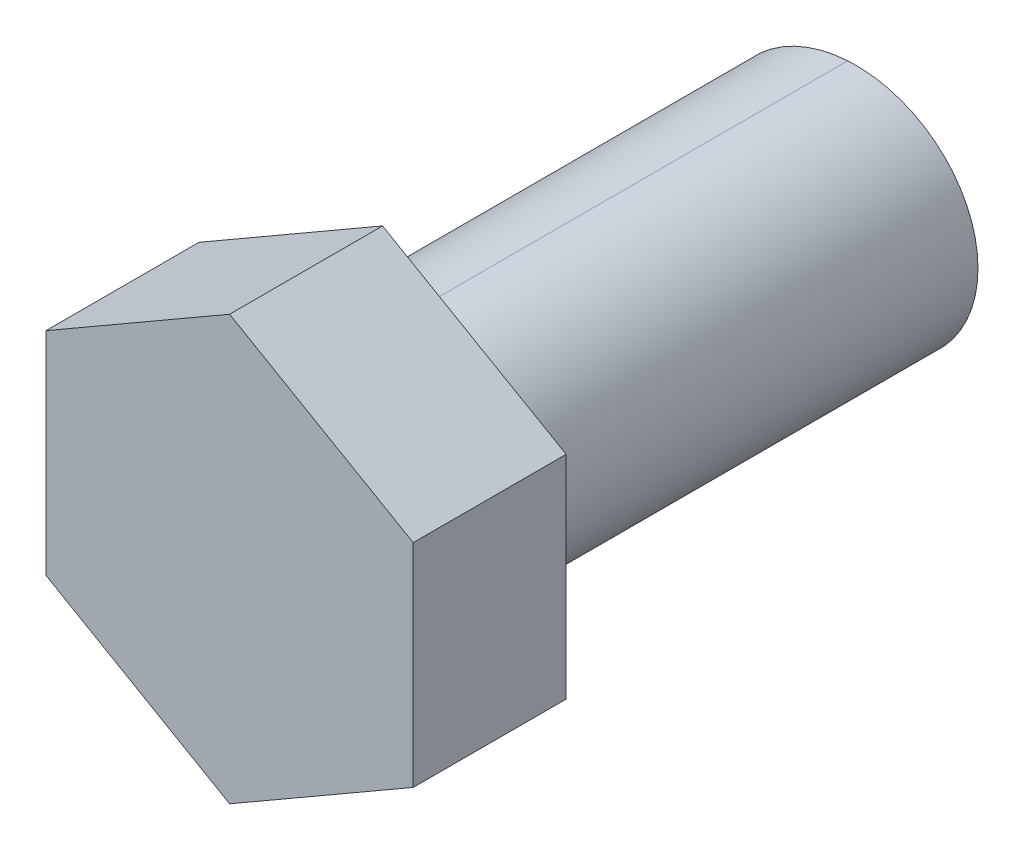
ISO-10303-21;
HEADER;
FILE_DESCRIPTION(('STEP AP214'),'2;1');
FILE_NAME('part.step','',(''),(''),'','','');
FILE_SCHEMA(('AUTOMOTIVE_DESIGN { 1 0 10303 214 1 1 1 1 }'));
ENDSEC;
DATA;
#1=APPLICATION_CONTEXT('core data for automotive mechanical design processes');
#2=APPLICATION_PROTOCOL_DEFINITION('international standard','automotive_design',2000,#1);
#3=PRODUCT_CONTEXT('',#1,'mechanical');
#4=PRODUCT('Part','Part','',(#3));
#5=PRODUCT_RELATED_PRODUCT_CATEGORY('part','',(#4));
#6=PRODUCT_DEFINITION_FORMATION('','',#4);
#7=PRODUCT_DEFINITION_CONTEXT('part definition',#1,'design');
#8=PRODUCT_DEFINITION('design','',#6,#7);
#9=PRODUCT_DEFINITION_SHAPE('','',#8);
#10=(LENGTH_UNIT() NAMED_UNIT(*) SI_UNIT(.MILLI.,.METRE.));
#11=(NAMED_UNIT(*) PLANE_ANGLE_UNIT() SI_UNIT($,.RADIAN.));
#12=(NAMED_UNIT(*) SI_UNIT($,.STERADIAN.) SOLID_ANGLE_UNIT());
#13=UNCERTAINTY_MEASURE_WITH_UNIT(LENGTH_MEASURE(1.E-05),#10,'distance_accuracy_value','');
#14=(GEOMETRIC_REPRESENTATION_CONTEXT(3) GLOBAL_UNCERTAINTY_ASSIGNED_CONTEXT((#13)) GLOBAL_UNIT_ASSIGNED_CONTEXT((#10,
#11,#12)) REPRESENTATION_CONTEXT('',''));
#15=CARTESIAN_POINT('',(0.,0.,0.));
#16=DIRECTION('',(0.,0.,1.));
#17=DIRECTION('',(1.,0.,0.));
#18=AXIS2_PLACEMENT_3D('',#15,#16,#17);
#19=CARTESIAN_POINT('',(9.525,5.49926131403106,16.2385888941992));
#20=DIRECTION('',(0.,0.,-1.));
#21=DIRECTION('',(-1.,0.,0.));
#22=AXIS2_PLACEMENT_3D('',#19,#20,#21);
#23=PLANE('',#22);
#24=DIRECTION('',(-0.866025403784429,0.500000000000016,0.));
#25=VECTOR('',#24,1.);
#26=CARTESIAN_POINT('',(0.,10.9985226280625,16.2385888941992));
#27=LINE('',#26,#25);
#28=CARTESIAN_POINT('',(0.,10.9985226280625,16.2385888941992));
#29=VERTEX_POINT('',#28);
#30=CARTESIAN_POINT('',(9.525,5.49926131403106,16.2385888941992));
#31=VERTEX_POINT('',#30);
#32=EDGE_CURVE('E116',#29,#31,#27,.F.);
#33=ORIENTED_EDGE('',*,*,#32,.F.);
#34=DIRECTION('',(-0.866025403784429,-0.500000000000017,0.));
#35=VECTOR('',#34,1.);
#36=CARTESIAN_POINT('',(-9.525,5.49926131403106,16.2385888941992));
#37=LINE('',#36,#35);
#38=CARTESIAN_POINT('',(-9.525,5.49926131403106,16.2385888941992));
#39=VERTEX_POINT('',#38);
#40=EDGE_CURVE('E89',#39,#29,#37,.F.);
#41=ORIENTED_EDGE('',*,*,#40,.F.);
#42=DIRECTION('',(0.,1.,0.));
#43=VECTOR('',#42,1.);
#44=CARTESIAN_POINT('',(-9.525,-5.49926131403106,16.2385888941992));
#45=LINE('',#44,#43);
#46=CARTESIAN_POINT('',(-9.525,-5.49926131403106,16.2385888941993));
#47=VERTEX_POINT('',#46);
#48=EDGE_CURVE('E95',#47,#39,#45,.T.);
#49=ORIENTED_EDGE('',*,*,#48,.F.);
#50=DIRECTION('',(0.866025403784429,-0.500000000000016,0.));
#51=VECTOR('',#50,1.);
#52=CARTESIAN_POINT('',(0.,-10.9985226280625,16.2385888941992));
#53=LINE('',#52,#51);
#54=CARTESIAN_POINT('',(0.,-10.9985226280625,16.2385888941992));
#55=VERTEX_POINT('',#54);
#56=EDGE_CURVE('E101',#55,#47,#53,.F.);
#57=ORIENTED_EDGE('',*,*,#56,.F.);
#58=DIRECTION('',(0.866025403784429,0.500000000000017,0.));
#59=VECTOR('',#58,1.);
#60=CARTESIAN_POINT('',(9.525,-5.49926131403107,16.2385888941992));
#61=LINE('',#60,#59);
#62=CARTESIAN_POINT('',(9.525,-5.49926131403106,16.2385888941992));
#63=VERTEX_POINT('',#62);
#64=EDGE_CURVE('E107',#63,#55,#61,.F.);
#65=ORIENTED_EDGE('',*,*,#64,.F.);
#66=DIRECTION('',(0.,1.,0.));
#67=VECTOR('',#66,1.);
#68=CARTESIAN_POINT('',(9.525,5.49926131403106,16.2385888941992));
#69=LINE('',#68,#67);
#70=EDGE_CURVE('E113',#31,#63,#69,.F.);
#71=ORIENTED_EDGE('',*,*,#70,.F.);
#72=EDGE_LOOP('',(#33,#41,#49,#57,#65,#71));
#73=FACE_BOUND('',#72,.T.);
#74=ADVANCED_FACE('F16',(#73),#23,.F.);
#75=CARTESIAN_POINT('',(0.,10.9985226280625,8.30108889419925));
#76=DIRECTION('',(0.500000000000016,0.866025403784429,0.));
#77=DIRECTION('',(-0.866025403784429,0.500000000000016,0.));
#78=AXIS2_PLACEMENT_3D('',#75,#76,#77);
#79=PLANE('',#78);
#80=DIRECTION('',(0.866025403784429,-0.500000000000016,0.));
#81=VECTOR('',#80,1.);
#82=CARTESIAN_POINT('',(0.,10.9985226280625,8.30108889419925));
#83=LINE('',#82,#81);
#84=CARTESIAN_POINT('',(0.,10.9985226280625,8.30108889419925));
#85=VERTEX_POINT('',#84);
#86=CARTESIAN_POINT('',(9.525,5.49926131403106,8.30108889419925));
#87=VERTEX_POINT('',#86);
#88=EDGE_CURVE('E54',#85,#87,#83,.T.);
#89=ORIENTED_EDGE('',*,*,#88,.F.);
#90=DIRECTION('',(0.,0.,1.));
#91=VECTOR('',#90,1.);
#92=CARTESIAN_POINT('',(0.,10.9985226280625,8.30108889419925));
#93=LINE('',#92,#91);
#94=EDGE_CURVE('E86',#29,#85,#93,.F.);
#95=ORIENTED_EDGE('',*,*,#94,.F.);
#96=ORIENTED_EDGE('',*,*,#32,.T.);
#97=DIRECTION('',(0.,0.,-1.));
#98=VECTOR('',#97,1.);
#99=CARTESIAN_POINT('',(9.525,5.49926131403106,8.30108889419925));
#100=LINE('',#99,#98);
#101=EDGE_CURVE('E110',#87,#31,#100,.F.);
#102=ORIENTED_EDGE('',*,*,#101,.F.);
#103=EDGE_LOOP('',(#89,#95,#96,#102));
#104=FACE_BOUND('',#103,.T.);
#105=ADVANCED_FACE('F123',(#104),#79,.T.);
#106=CARTESIAN_POINT('',(9.525,5.49926131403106,8.30108889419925));
#107=DIRECTION('',(1.,0.,0.));
#108=DIRECTION('',(0.,0.,-1.));
#109=AXIS2_PLACEMENT_3D('',#106,#107,#108);
#110=PLANE('',#109);
#111=DIRECTION('',(0.,1.,0.));
#112=VECTOR('',#111,1.);
#113=CARTESIAN_POINT('',(9.525,0.,8.30108889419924));
#114=LINE('',#113,#112);
#115=CARTESIAN_POINT('',(9.525,-5.49926131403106,8.30108889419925));
#116=VERTEX_POINT('',#115);
#117=EDGE_CURVE('E78',#87,#116,#114,.F.);
#118=ORIENTED_EDGE('',*,*,#117,.F.);
#119=ORIENTED_EDGE('',*,*,#101,.T.);
#120=ORIENTED_EDGE('',*,*,#70,.T.);
#121=DIRECTION('',(0.,0.,1.));
#122=VECTOR('',#121,1.);
#123=CARTESIAN_POINT('',(9.525,-5.49926131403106,8.30108889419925));
#124=LINE('',#123,#122);
#125=EDGE_CURVE('E104',#116,#63,#124,.T.);
#126=ORIENTED_EDGE('',*,*,#125,.F.);
#127=EDGE_LOOP('',(#118,#119,#120,#126));
#128=FACE_BOUND('',#127,.T.);
#129=ADVANCED_FACE('F132',(#128),#110,.T.);
#130=CARTESIAN_POINT('',(9.525,-5.49926131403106,8.30108889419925));
#131=DIRECTION('',(0.500000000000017,-0.866025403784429,0.));
#132=DIRECTION('',(0.866025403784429,0.500000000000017,0.));
#133=AXIS2_PLACEMENT_3D('',#130,#131,#132);
#134=PLANE('',#133);
#135=DIRECTION('',(-0.866025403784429,-0.500000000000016,0.));
#136=VECTOR('',#135,1.);
#137=CARTESIAN_POINT('',(9.525,-5.49926131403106,8.30108889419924));
#138=LINE('',#137,#136);
#139=CARTESIAN_POINT('',(0.,-10.9985226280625,8.30108889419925));
#140=VERTEX_POINT('',#139);
#141=EDGE_CURVE('E75',#116,#140,#138,.T.);
#142=ORIENTED_EDGE('',*,*,#141,.F.);
#143=ORIENTED_EDGE('',*,*,#125,.T.);
#144=ORIENTED_EDGE('',*,*,#64,.T.);
#145=DIRECTION('',(0.,0.,1.));
#146=VECTOR('',#145,1.);
#147=CARTESIAN_POINT('',(0.,-10.9985226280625,8.30108889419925));
#148=LINE('',#147,#146);
#149=EDGE_CURVE('E98',#140,#55,#148,.T.);
#150=ORIENTED_EDGE('',*,*,#149,.F.);
#151=EDGE_LOOP('',(#142,#143,#144,#150));
#152=FACE_BOUND('',#151,.T.);
#153=ADVANCED_FACE('F170',(#152),#134,.T.);
#154=CARTESIAN_POINT('',(0.,-10.9985226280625,8.30108889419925));
#155=DIRECTION('',(-0.500000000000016,-0.866025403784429,0.));
#156=DIRECTION('',(0.866025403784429,-0.500000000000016,0.));
#157=AXIS2_PLACEMENT_3D('',#154,#155,#156);
#158=PLANE('',#157);
#159=DIRECTION('',(-0.866025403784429,0.500000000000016,0.));
#160=VECTOR('',#159,1.);
#161=CARTESIAN_POINT('',(0.,-10.9985226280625,8.30108889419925));
#162=LINE('',#161,#160);
#163=CARTESIAN_POINT('',(-9.525,-5.49926131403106,8.30108889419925));
#164=VERTEX_POINT('',#163);
#165=EDGE_CURVE('E72',#140,#164,#162,.T.);
#166=ORIENTED_EDGE('',*,*,#165,.F.);
#167=ORIENTED_EDGE('',*,*,#149,.T.);
#168=ORIENTED_EDGE('',*,*,#56,.T.);
#169=DIRECTION('',(0.,0.,1.));
#170=VECTOR('',#169,1.);
#171=CARTESIAN_POINT('',(-9.525,-5.49926131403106,8.30108889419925));
#172=LINE('',#171,#170);
#173=EDGE_CURVE('E92',#164,#47,#172,.T.);
#174=ORIENTED_EDGE('',*,*,#173,.F.);
#175=EDGE_LOOP('',(#166,#167,#168,#174));
#176=FACE_BOUND('',#175,.T.);
#177=ADVANCED_FACE('F160',(#176),#158,.T.);
#178=CARTESIAN_POINT('',(-9.525,-5.49926131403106,8.30108889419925));
#179=DIRECTION('',(-1.,0.,0.));
#180=DIRECTION('',(0.,0.,1.));
#181=AXIS2_PLACEMENT_3D('',#178,#179,#180);
#182=PLANE('',#181);
#183=DIRECTION('',(0.,1.,0.));
#184=VECTOR('',#183,1.);
#185=CARTESIAN_POINT('',(-9.525,0.,8.30108889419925));
#186=LINE('',#185,#184);
#187=CARTESIAN_POINT('',(-9.525,5.49926131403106,8.30108889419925));
#188=VERTEX_POINT('',#187);
#189=EDGE_CURVE('E69',#164,#188,#186,.T.);
#190=ORIENTED_EDGE('',*,*,#189,.F.);
#191=ORIENTED_EDGE('',*,*,#173,.T.);
#192=ORIENTED_EDGE('',*,*,#48,.T.);
#193=DIRECTION('',(0.,0.,1.));
#194=VECTOR('',#193,1.);
#195=CARTESIAN_POINT('',(-9.525,5.49926131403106,8.30108889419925));
#196=LINE('',#195,#194);
#197=EDGE_CURVE('E83',#188,#39,#196,.T.);
#198=ORIENTED_EDGE('',*,*,#197,.F.);
#199=EDGE_LOOP('',(#190,#191,#192,#198));
#200=FACE_BOUND('',#199,.T.);
#201=ADVANCED_FACE('F153',(#200),#182,.T.);
#202=CARTESIAN_POINT('',(-9.525,5.49926131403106,8.30108889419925));
#203=DIRECTION('',(-0.500000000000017,0.866025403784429,0.));
#204=DIRECTION('',(-0.866025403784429,-0.500000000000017,0.));
#205=AXIS2_PLACEMENT_3D('',#202,#203,#204);
#206=PLANE('',#205);
#207=DIRECTION('',(0.866025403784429,0.500000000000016,0.));
#208=VECTOR('',#207,1.);
#209=CARTESIAN_POINT('',(-9.525,5.49926131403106,8.30108889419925));
#210=LINE('',#209,#208);
#211=EDGE_CURVE('E63',#188,#85,#210,.T.);
#212=ORIENTED_EDGE('',*,*,#211,.F.);
#213=ORIENTED_EDGE('',*,*,#197,.T.);
#214=ORIENTED_EDGE('',*,*,#40,.T.);
#215=ORIENTED_EDGE('',*,*,#94,.T.);
#216=EDGE_LOOP('',(#212,#213,#214,#215));
#217=FACE_BOUND('',#216,.T.);
#218=ADVANCED_FACE('F143',(#217),#206,.T.);
#219=CARTESIAN_POINT('',(-0.826158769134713,0.,-15.7756104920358));
#220=DIRECTION('',(0.0643823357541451,0.,0.997925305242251));
#221=DIRECTION('',(0.997925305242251,0.,-0.0643823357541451));
#222=AXIS2_PLACEMENT_3D('',#219,#220,#221);
#223=PLANE('',#222);
#224=CARTESIAN_POINT('',(0.,0.,-15.8289111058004));
#225=DIRECTION('',(0.0643823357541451,0.,0.997925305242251));
#226=DIRECTION('',(-0.997925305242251,0.,0.0643823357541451));
#227=AXIS2_PLACEMENT_3D('',#224,#225,#226);
#228=ELLIPSE('',#227,6.363201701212,6.35);
#229=CARTESIAN_POINT('',(0.,6.35,-15.8289111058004));
#230=VERTEX_POINT('',#229);
#231=CARTESIAN_POINT('',(-6.35,0.,-15.4192333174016));
#232=VERTEX_POINT('',#231);
#233=EDGE_CURVE('E19',#230,#232,#228,.T.);
#234=ORIENTED_EDGE('',*,*,#233,.F.);
#235=CARTESIAN_POINT('',(0.,0.,-15.8289111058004));
#236=DIRECTION('',(0.0643823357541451,0.,0.997925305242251));
#237=DIRECTION('',(-0.997925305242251,0.,0.0643823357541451));
#238=AXIS2_PLACEMENT_3D('',#235,#236,#237);
#239=ELLIPSE('',#238,6.363201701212,6.35);
#240=CARTESIAN_POINT('',(0.,-6.35,-15.8289111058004));
#241=VERTEX_POINT('',#240);
#242=EDGE_CURVE('E56',#241,#230,#239,.T.);
#243=ORIENTED_EDGE('',*,*,#242,.F.);
#244=CARTESIAN_POINT('',(0.,0.,-15.8289111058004));
#245=DIRECTION('',(0.0643823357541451,0.,0.997925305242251));
#246=DIRECTION('',(-0.997925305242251,0.,0.0643823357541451));
#247=AXIS2_PLACEMENT_3D('',#244,#245,#246);
#248=ELLIPSE('',#247,6.363201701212,6.35);
#249=EDGE_CURVE('E48',#232,#241,#248,.T.);
#250=ORIENTED_EDGE('',*,*,#249,.F.);
#251=EDGE_LOOP('',(#234,#243,#250));
#252=FACE_BOUND('',#251,.T.);
#253=ADVANCED_FACE('F57',(#252),#223,.F.);
#254=CARTESIAN_POINT('',(0.,0.,-9.4789111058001));
#255=DIRECTION('',(0.,0.,1.));
#256=DIRECTION('',(1.,0.,0.));
#257=AXIS2_PLACEMENT_3D('',#254,#255,#256);
#258=CYLINDRICAL_SURFACE('',#257,6.35);
#259=ORIENTED_EDGE('',*,*,#233,.T.);
#260=ORIENTED_EDGE('',*,*,#249,.T.);
#261=DIRECTION('',(0.,0.,1.));
#262=VECTOR('',#261,1.);
#263=CARTESIAN_POINT('',(0.,-6.35,-9.4789111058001));
#264=LINE('',#263,#262);
#265=CARTESIAN_POINT('',(0.,-6.35,8.30108889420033));
#266=VERTEX_POINT('',#265);
#267=EDGE_CURVE('E52',#266,#241,#264,.F.);
#268=ORIENTED_EDGE('',*,*,#267,.F.);
#269=CARTESIAN_POINT('',(0.,0.,8.30108889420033));
#270=DIRECTION('',(0.,0.,1.));
#271=DIRECTION('',(1.,0.,0.));
#272=AXIS2_PLACEMENT_3D('',#269,#270,#271);
#273=CIRCLE('',#272,6.35);
#274=CARTESIAN_POINT('',(0.,6.35,8.30108889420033));
#275=VERTEX_POINT('',#274);
#276=EDGE_CURVE('E34',#275,#266,#273,.T.);
#277=ORIENTED_EDGE('',*,*,#276,.F.);
#278=DIRECTION('',(0.,0.,1.));
#279=VECTOR('',#278,1.);
#280=CARTESIAN_POINT('',(0.,6.35,-9.4789111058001));
#281=LINE('',#280,#279);
#282=EDGE_CURVE('E25',#230,#275,#281,.T.);
#283=ORIENTED_EDGE('',*,*,#282,.F.);
#284=EDGE_LOOP('',(#259,#260,#268,#277,#283));
#285=FACE_BOUND('',#284,.T.);
#286=ADVANCED_FACE('F50',(#285),#258,.T.);
#287=CARTESIAN_POINT('',(0.,0.,8.30108889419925));
#288=DIRECTION('',(0.,0.,-1.));
#289=DIRECTION('',(-1.,0.,0.));
#290=AXIS2_PLACEMENT_3D('',#287,#288,#289);
#291=PLANE('',#290);
#292=ORIENTED_EDGE('',*,*,#276,.T.);
#293=CARTESIAN_POINT('',(0.,0.,8.30108889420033));
#294=DIRECTION('',(0.,0.,1.));
#295=DIRECTION('',(1.,0.,0.));
#296=AXIS2_PLACEMENT_3D('',#293,#294,#295);
#297=CIRCLE('',#296,6.35);
#298=EDGE_CURVE('E11',#275,#266,#297,.F.);
#299=ORIENTED_EDGE('',*,*,#298,.F.);
#300=EDGE_LOOP('',(#292,#299));
#301=FACE_BOUND('',#300,.T.);
#302=ORIENTED_EDGE('',*,*,#189,.T.);
#303=ORIENTED_EDGE('',*,*,#211,.T.);
#304=ORIENTED_EDGE('',*,*,#88,.T.);
#305=ORIENTED_EDGE('',*,*,#117,.T.);
#306=ORIENTED_EDGE('',*,*,#141,.T.);
#307=ORIENTED_EDGE('',*,*,#165,.T.);
#308=EDGE_LOOP('',(#302,#303,#304,#305,#306,#307));
#309=FACE_BOUND('',#308,.T.);
#310=ADVANCED_FACE('F139',(#301,#309),#291,.T.);
#311=CARTESIAN_POINT('',(0.,0.,-9.4789111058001));
#312=DIRECTION('',(0.,0.,1.));
#313=DIRECTION('',(1.,0.,0.));
#314=AXIS2_PLACEMENT_3D('',#311,#312,#313);
#315=CYLINDRICAL_SURFACE('',#314,6.35);
#316=ORIENTED_EDGE('',*,*,#282,.T.);
#317=ORIENTED_EDGE('',*,*,#298,.T.);
#318=ORIENTED_EDGE('',*,*,#267,.T.);
#319=ORIENTED_EDGE('',*,*,#242,.T.);
#320=EDGE_LOOP('',(#316,#317,#318,#319));
#321=FACE_BOUND('',#320,.T.);
#322=ADVANCED_FACE('F61',(#321),#315,.T.);
#323=CLOSED_SHELL('',(#74,#105,#129,#153,#177,#201,#218,#253,#286,#310,#322));
#324=MANIFOLD_SOLID_BREP('B1',#323);
#325=ADVANCED_BREP_SHAPE_REPRESENTATION('',(#18,#324),#14);
#326=SHAPE_DEFINITION_REPRESENTATION(#9,#325);
ENDSEC;
END-ISO-10303-21;
